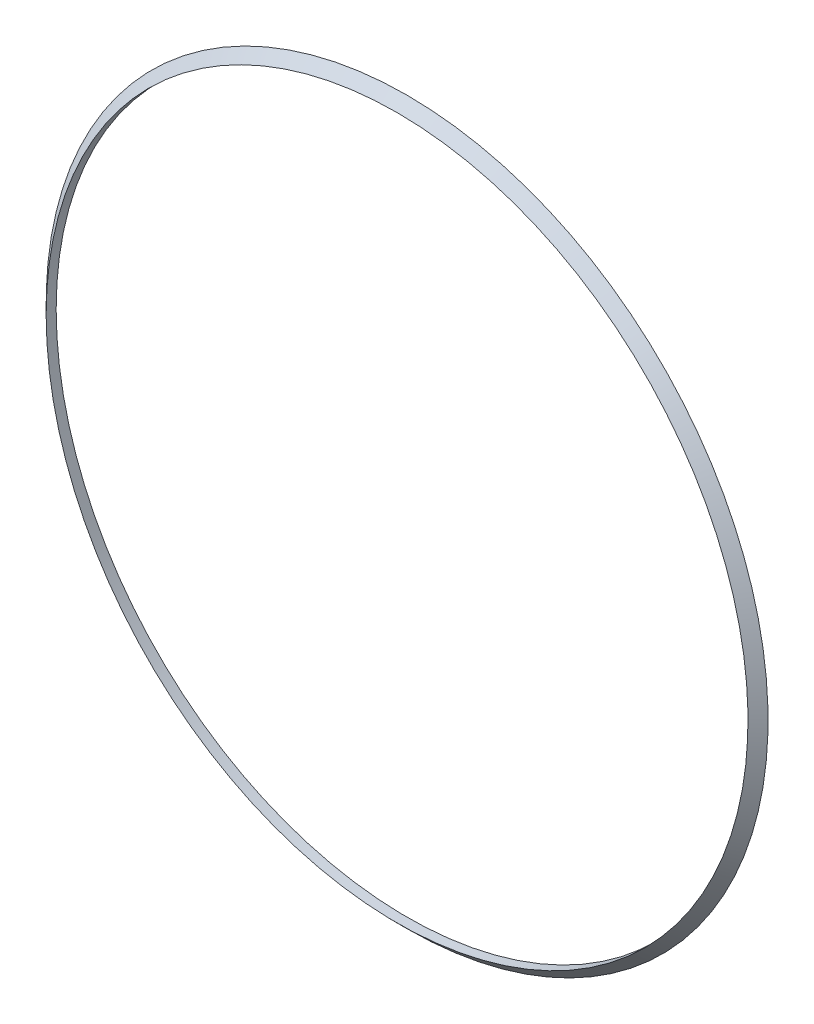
ISO-10303-21;
HEADER;
FILE_DESCRIPTION(('STEP AP214'),'2;1');
FILE_NAME('part.step','',(''),(''),'','','');
FILE_SCHEMA(('AUTOMOTIVE_DESIGN { 1 0 10303 214 1 1 1 1 }'));
ENDSEC;
DATA;
#1=APPLICATION_CONTEXT('core data for automotive mechanical design processes');
#2=APPLICATION_PROTOCOL_DEFINITION('international standard','automotive_design',2000,#1);
#3=PRODUCT_CONTEXT('',#1,'mechanical');
#4=PRODUCT('Part','Part','',(#3));
#5=PRODUCT_RELATED_PRODUCT_CATEGORY('part','',(#4));
#6=PRODUCT_DEFINITION_FORMATION('','',#4);
#7=PRODUCT_DEFINITION_CONTEXT('part definition',#1,'design');
#8=PRODUCT_DEFINITION('design','',#6,#7);
#9=PRODUCT_DEFINITION_SHAPE('','',#8);
#10=(LENGTH_UNIT() NAMED_UNIT(*) SI_UNIT(.MILLI.,.METRE.));
#11=(NAMED_UNIT(*) PLANE_ANGLE_UNIT() SI_UNIT($,.RADIAN.));
#12=(NAMED_UNIT(*) SI_UNIT($,.STERADIAN.) SOLID_ANGLE_UNIT());
#13=UNCERTAINTY_MEASURE_WITH_UNIT(LENGTH_MEASURE(1.E-05),#10,'distance_accuracy_value','');
#14=(GEOMETRIC_REPRESENTATION_CONTEXT(3) GLOBAL_UNCERTAINTY_ASSIGNED_CONTEXT((#13)) GLOBAL_UNIT_ASSIGNED_CONTEXT((#10,
#11,#12)) REPRESENTATION_CONTEXT('',''));
#15=CARTESIAN_POINT('',(0.,0.,0.));
#16=DIRECTION('',(0.,0.,1.));
#17=DIRECTION('',(1.,0.,0.));
#18=AXIS2_PLACEMENT_3D('',#15,#16,#17);
#19=CARTESIAN_POINT('',(0.,0.,119.999999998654));
#20=DIRECTION('',(0.,0.,-1.));
#21=DIRECTION('',(0.,1.,0.));
#22=AXIS2_PLACEMENT_3D('',#19,#20,#21);
#23=CONICAL_SURFACE('',#22,107.999999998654,0.785398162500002);
#24=CARTESIAN_POINT('',(0.,0.,123.));
#25=DIRECTION('',(0.,0.,-1.));
#26=DIRECTION('',(-1.,0.,0.));
#27=AXIS2_PLACEMENT_3D('',#24,#25,#26);
#28=CIRCLE('',#27,105.);
#29=CARTESIAN_POINT('',(-105.,0.,123.));
#30=VERTEX_POINT('',#29);
#31=EDGE_CURVE('E25',#30,#30,#28,.T.);
#32=ORIENTED_EDGE('',*,*,#31,.T.);
#33=EDGE_LOOP('',(#32));
#34=FACE_BOUND('',#33,.T.);
#35=CARTESIAN_POINT('',(0.,0.,119.999999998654));
#36=DIRECTION('',(0.,0.,-1.));
#37=DIRECTION('',(0.,1.,0.));
#38=AXIS2_PLACEMENT_3D('',#35,#36,#37);
#39=CIRCLE('',#38,107.999999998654);
#40=CARTESIAN_POINT('',(0.,107.999999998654,119.999999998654));
#41=VERTEX_POINT('',#40);
#42=EDGE_CURVE('E18',#41,#41,#39,.T.);
#43=ORIENTED_EDGE('',*,*,#42,.F.);
#44=EDGE_LOOP('',(#43));
#45=FACE_BOUND('',#44,.T.);
#46=ADVANCED_FACE('F14',(#34,#45),#23,.T.);
#47=CARTESIAN_POINT('',(0.,0.,126.));
#48=DIRECTION('',(0.,0.,-1.));
#49=DIRECTION('',(-1.,0.,0.));
#50=AXIS2_PLACEMENT_3D('',#47,#48,#49);
#51=CYLINDRICAL_SURFACE('',#50,105.);
#52=ORIENTED_EDGE('',*,*,#31,.F.);
#53=EDGE_LOOP('',(#52));
#54=FACE_BOUND('',#53,.T.);
#55=CARTESIAN_POINT('',(0.,0.,120.));
#56=DIRECTION('',(0.,0.,-1.));
#57=DIRECTION('',(-1.,0.,0.));
#58=AXIS2_PLACEMENT_3D('',#55,#56,#57);
#59=CIRCLE('',#58,105.);
#60=CARTESIAN_POINT('',(-105.,0.,120.));
#61=VERTEX_POINT('',#60);
#62=EDGE_CURVE('E9',#61,#61,#59,.F.);
#63=ORIENTED_EDGE('',*,*,#62,.F.);
#64=EDGE_LOOP('',(#63));
#65=FACE_BOUND('',#64,.T.);
#66=ADVANCED_FACE('F32',(#54,#65),#51,.F.);
#67=CARTESIAN_POINT('',(0.,0.,120.));
#68=DIRECTION('',(0.,0.,-1.));
#69=DIRECTION('',(-1.,0.,0.));
#70=AXIS2_PLACEMENT_3D('',#67,#68,#69);
#71=PLANE('',#70);
#72=ORIENTED_EDGE('',*,*,#62,.T.);
#73=EDGE_LOOP('',(#72));
#74=FACE_BOUND('',#73,.T.);
#75=ORIENTED_EDGE('',*,*,#42,.T.);
#76=EDGE_LOOP('',(#75));
#77=FACE_BOUND('',#76,.T.);
#78=ADVANCED_FACE('F16',(#74,#77),#71,.T.);
#79=CLOSED_SHELL('',(#46,#66,#78));
#80=MANIFOLD_SOLID_BREP('B1',#79);
#81=ADVANCED_BREP_SHAPE_REPRESENTATION('',(#18,#80),#14);
#82=SHAPE_DEFINITION_REPRESENTATION(#9,#81);
ENDSEC;
END-ISO-10303-21;
